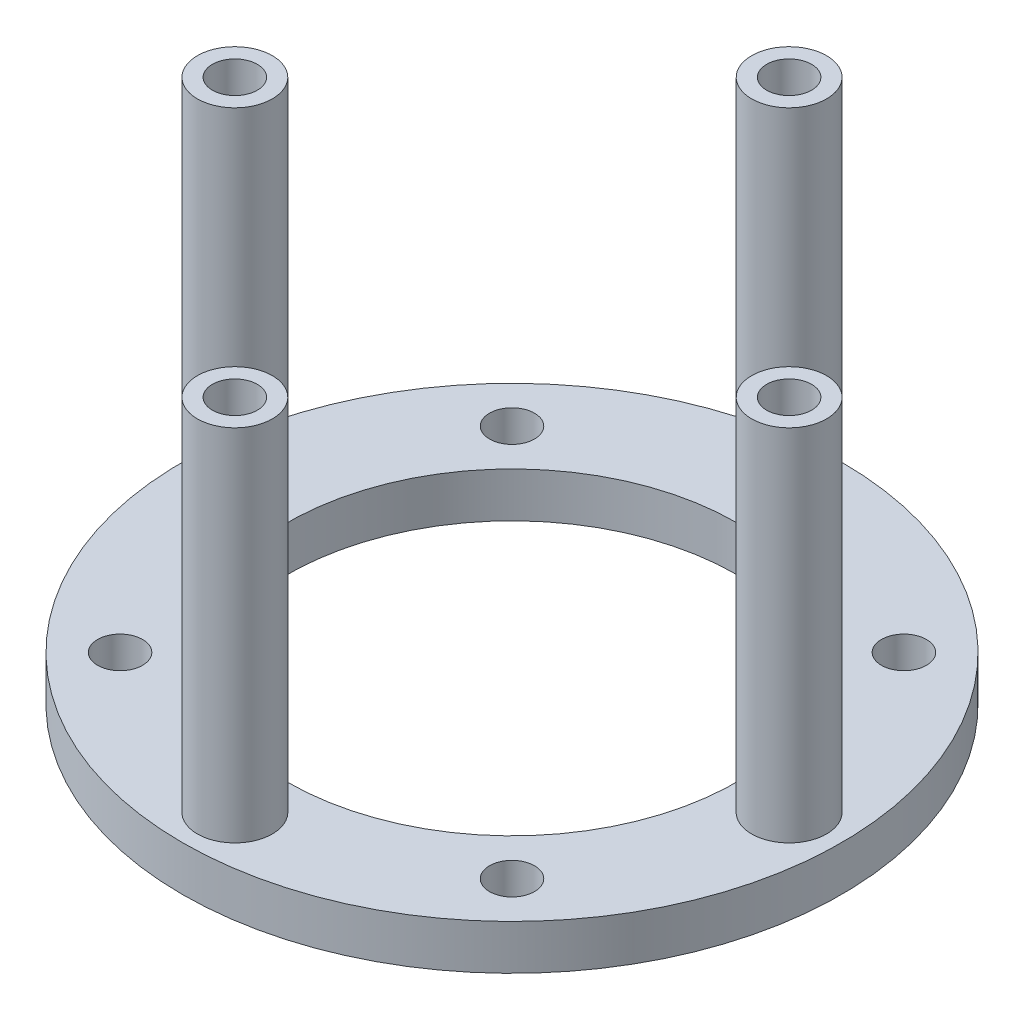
ISO-10303-21;
HEADER;
FILE_DESCRIPTION(('STEP AP214'),'2;1');
FILE_NAME('part.step','',(''),(''),'','','');
FILE_SCHEMA(('AUTOMOTIVE_DESIGN { 1 0 10303 214 1 1 1 1 }'));
ENDSEC;
DATA;
#1=APPLICATION_CONTEXT('core data for automotive mechanical design processes');
#2=APPLICATION_PROTOCOL_DEFINITION('international standard','automotive_design',2000,#1);
#3=PRODUCT_CONTEXT('',#1,'mechanical');
#4=PRODUCT('Part','Part','',(#3));
#5=PRODUCT_RELATED_PRODUCT_CATEGORY('part','',(#4));
#6=PRODUCT_DEFINITION_FORMATION('','',#4);
#7=PRODUCT_DEFINITION_CONTEXT('part definition',#1,'design');
#8=PRODUCT_DEFINITION('design','',#6,#7);
#9=PRODUCT_DEFINITION_SHAPE('','',#8);
#10=(LENGTH_UNIT() NAMED_UNIT(*) SI_UNIT(.MILLI.,.METRE.));
#11=(NAMED_UNIT(*) PLANE_ANGLE_UNIT() SI_UNIT($,.RADIAN.));
#12=(NAMED_UNIT(*) SI_UNIT($,.STERADIAN.) SOLID_ANGLE_UNIT());
#13=UNCERTAINTY_MEASURE_WITH_UNIT(LENGTH_MEASURE(1.E-05),#10,'distance_accuracy_value','');
#14=(GEOMETRIC_REPRESENTATION_CONTEXT(3) GLOBAL_UNCERTAINTY_ASSIGNED_CONTEXT((#13)) GLOBAL_UNIT_ASSIGNED_CONTEXT((#10,
#11,#12)) REPRESENTATION_CONTEXT('',''));
#15=CARTESIAN_POINT('',(0.,0.,0.));
#16=DIRECTION('',(0.,0.,1.));
#17=DIRECTION('',(1.,0.,0.));
#18=AXIS2_PLACEMENT_3D('',#15,#16,#17);
#19=CARTESIAN_POINT('',(0.,3.,0.));
#20=DIRECTION('',(0.,1.,0.));
#21=DIRECTION('',(0.,0.,1.));
#22=AXIS2_PLACEMENT_3D('',#19,#20,#21);
#23=PLANE('',#22);
#24=CARTESIAN_POINT('',(-13.081475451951,3.,-13.0814754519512));
#25=DIRECTION('',(0.,1.,0.));
#26=DIRECTION('',(0.,0.,1.));
#27=AXIS2_PLACEMENT_3D('',#24,#25,#26);
#28=CIRCLE('',#27,1.5);
#29=CARTESIAN_POINT('',(-13.081475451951,3.,-11.5814754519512));
#30=VERTEX_POINT('',#29);
#31=EDGE_CURVE('E158',#30,#30,#28,.T.);
#32=ORIENTED_EDGE('',*,*,#31,.F.);
#33=EDGE_LOOP('',(#32));
#34=FACE_BOUND('',#33,.T.);
#35=CARTESIAN_POINT('',(-13.0814754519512,3.,13.0814754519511));
#36=DIRECTION('',(0.,1.,0.));
#37=DIRECTION('',(0.,0.,1.));
#38=AXIS2_PLACEMENT_3D('',#35,#36,#37);
#39=CIRCLE('',#38,1.5);
#40=CARTESIAN_POINT('',(-13.0814754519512,3.,14.5814754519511));
#41=VERTEX_POINT('',#40);
#42=EDGE_CURVE('E162',#41,#41,#39,.T.);
#43=ORIENTED_EDGE('',*,*,#42,.F.);
#44=EDGE_LOOP('',(#43));
#45=FACE_BOUND('',#44,.T.);
#46=CARTESIAN_POINT('',(13.0814754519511,3.,13.0814754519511));
#47=DIRECTION('',(0.,1.,0.));
#48=DIRECTION('',(0.,0.,1.));
#49=AXIS2_PLACEMENT_3D('',#46,#47,#48);
#50=CIRCLE('',#49,1.5);
#51=CARTESIAN_POINT('',(13.0814754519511,3.,14.5814754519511));
#52=VERTEX_POINT('',#51);
#53=EDGE_CURVE('E166',#52,#52,#50,.T.);
#54=ORIENTED_EDGE('',*,*,#53,.F.);
#55=EDGE_LOOP('',(#54));
#56=FACE_BOUND('',#55,.T.);
#57=CARTESIAN_POINT('',(13.0814754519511,3.,-13.0814754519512));
#58=DIRECTION('',(0.,1.,0.));
#59=DIRECTION('',(0.,0.,1.));
#60=AXIS2_PLACEMENT_3D('',#57,#58,#59);
#61=CIRCLE('',#60,1.5);
#62=CARTESIAN_POINT('',(13.0814754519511,3.,-11.5814754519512));
#63=VERTEX_POINT('',#62);
#64=EDGE_CURVE('E69',#63,#63,#61,.T.);
#65=ORIENTED_EDGE('',*,*,#64,.F.);
#66=EDGE_LOOP('',(#65));
#67=FACE_BOUND('',#66,.T.);
#68=CARTESIAN_POINT('',(-18.5,3.,-1.93777214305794E-13));
#69=DIRECTION('',(0.,1.,0.));
#70=DIRECTION('',(0.,0.,1.));
#71=AXIS2_PLACEMENT_3D('',#68,#69,#70);
#72=CIRCLE('',#71,2.5);
#73=CARTESIAN_POINT('',(-18.5,3.,2.49999999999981));
#74=VERTEX_POINT('',#73);
#75=EDGE_CURVE('E94',#74,#74,#72,.T.);
#76=ORIENTED_EDGE('',*,*,#75,.F.);
#77=EDGE_LOOP('',(#76));
#78=FACE_BOUND('',#77,.T.);
#79=CARTESIAN_POINT('',(-1.29184809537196E-13,3.,18.5));
#80=DIRECTION('',(0.,1.,0.));
#81=DIRECTION('',(0.,0.,1.));
#82=AXIS2_PLACEMENT_3D('',#79,#80,#81);
#83=CIRCLE('',#82,2.5);
#84=CARTESIAN_POINT('',(-1.29184809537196E-13,3.,21.));
#85=VERTEX_POINT('',#84);
#86=EDGE_CURVE('E104',#85,#85,#83,.T.);
#87=ORIENTED_EDGE('',*,*,#86,.F.);
#88=EDGE_LOOP('',(#87));
#89=FACE_BOUND('',#88,.T.);
#90=CARTESIAN_POINT('',(18.5,3.,0.));
#91=DIRECTION('',(0.,1.,0.));
#92=DIRECTION('',(0.,0.,1.));
#93=AXIS2_PLACEMENT_3D('',#90,#91,#92);
#94=CIRCLE('',#93,2.5);
#95=CARTESIAN_POINT('',(18.5,3.,2.50000000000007));
#96=VERTEX_POINT('',#95);
#97=EDGE_CURVE('E112',#96,#96,#94,.T.);
#98=ORIENTED_EDGE('',*,*,#97,.F.);
#99=EDGE_LOOP('',(#98));
#100=FACE_BOUND('',#99,.T.);
#101=CARTESIAN_POINT('',(0.,3.,-18.5));
#102=DIRECTION('',(0.,1.,0.));
#103=DIRECTION('',(0.,0.,1.));
#104=AXIS2_PLACEMENT_3D('',#101,#102,#103);
#105=CIRCLE('',#104,2.5);
#106=CARTESIAN_POINT('',(0.,3.,-16.));
#107=VERTEX_POINT('',#106);
#108=EDGE_CURVE('E116',#107,#107,#105,.T.);
#109=ORIENTED_EDGE('',*,*,#108,.F.);
#110=EDGE_LOOP('',(#109));
#111=FACE_BOUND('',#110,.T.);
#112=CARTESIAN_POINT('',(0.,3.,0.));
#113=DIRECTION('',(0.,1.,0.));
#114=DIRECTION('',(0.,0.,1.));
#115=AXIS2_PLACEMENT_3D('',#112,#113,#114);
#116=CIRCLE('',#115,22.);
#117=CARTESIAN_POINT('',(0.,3.,22.));
#118=VERTEX_POINT('',#117);
#119=EDGE_CURVE('E10',#118,#118,#116,.T.);
#120=ORIENTED_EDGE('',*,*,#119,.T.);
#121=EDGE_LOOP('',(#120));
#122=FACE_BOUND('',#121,.T.);
#123=CARTESIAN_POINT('',(0.,3.,0.));
#124=DIRECTION('',(0.,1.,0.));
#125=DIRECTION('',(0.,0.,1.));
#126=AXIS2_PLACEMENT_3D('',#123,#124,#125);
#127=CIRCLE('',#126,15.);
#128=CARTESIAN_POINT('',(0.,3.,15.));
#129=VERTEX_POINT('',#128);
#130=EDGE_CURVE('E58',#129,#129,#127,.T.);
#131=ORIENTED_EDGE('',*,*,#130,.F.);
#132=EDGE_LOOP('',(#131));
#133=FACE_BOUND('',#132,.T.);
#134=ADVANCED_FACE('F43',(#34,#45,#56,#67,#78,#89,#100,#111,#122,#133),#23,.T.);
#135=CARTESIAN_POINT('',(0.,0.,0.));
#136=DIRECTION('',(0.,1.,0.));
#137=DIRECTION('',(0.,0.,1.));
#138=AXIS2_PLACEMENT_3D('',#135,#136,#137);
#139=PLANE('',#138);
#140=CARTESIAN_POINT('',(-13.081475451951,0.,-13.0814754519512));
#141=DIRECTION('',(0.,1.,0.));
#142=DIRECTION('',(0.,0.,1.));
#143=AXIS2_PLACEMENT_3D('',#140,#141,#142);
#144=CIRCLE('',#143,1.5);
#145=CARTESIAN_POINT('',(-13.081475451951,0.,-11.5814754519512));
#146=VERTEX_POINT('',#145);
#147=EDGE_CURVE('E47',#146,#146,#144,.T.);
#148=ORIENTED_EDGE('',*,*,#147,.T.);
#149=EDGE_LOOP('',(#148));
#150=FACE_BOUND('',#149,.T.);
#151=CARTESIAN_POINT('',(-13.0814754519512,0.,13.0814754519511));
#152=DIRECTION('',(0.,1.,0.));
#153=DIRECTION('',(0.,0.,1.));
#154=AXIS2_PLACEMENT_3D('',#151,#152,#153);
#155=CIRCLE('',#154,1.5);
#156=CARTESIAN_POINT('',(-13.0814754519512,0.,14.5814754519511));
#157=VERTEX_POINT('',#156);
#158=EDGE_CURVE('E72',#157,#157,#155,.T.);
#159=ORIENTED_EDGE('',*,*,#158,.T.);
#160=EDGE_LOOP('',(#159));
#161=FACE_BOUND('',#160,.T.);
#162=CARTESIAN_POINT('',(13.0814754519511,0.,13.0814754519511));
#163=DIRECTION('',(0.,1.,0.));
#164=DIRECTION('',(0.,0.,1.));
#165=AXIS2_PLACEMENT_3D('',#162,#163,#164);
#166=CIRCLE('',#165,1.5);
#167=CARTESIAN_POINT('',(13.0814754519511,0.,14.5814754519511));
#168=VERTEX_POINT('',#167);
#169=EDGE_CURVE('E68',#168,#168,#166,.T.);
#170=ORIENTED_EDGE('',*,*,#169,.T.);
#171=EDGE_LOOP('',(#170));
#172=FACE_BOUND('',#171,.T.);
#173=CARTESIAN_POINT('',(13.0814754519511,0.,-13.0814754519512));
#174=DIRECTION('',(0.,1.,0.));
#175=DIRECTION('',(0.,0.,1.));
#176=AXIS2_PLACEMENT_3D('',#173,#174,#175);
#177=CIRCLE('',#176,1.5);
#178=CARTESIAN_POINT('',(13.0814754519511,0.,-11.5814754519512));
#179=VERTEX_POINT('',#178);
#180=EDGE_CURVE('E64',#179,#179,#177,.T.);
#181=ORIENTED_EDGE('',*,*,#180,.T.);
#182=EDGE_LOOP('',(#181));
#183=FACE_BOUND('',#182,.T.);
#184=CARTESIAN_POINT('',(0.,0.,0.));
#185=DIRECTION('',(0.,1.,0.));
#186=DIRECTION('',(0.,0.,1.));
#187=AXIS2_PLACEMENT_3D('',#184,#185,#186);
#188=CIRCLE('',#187,22.);
#189=CARTESIAN_POINT('',(0.,0.,22.));
#190=VERTEX_POINT('',#189);
#191=EDGE_CURVE('E52',#190,#190,#188,.T.);
#192=ORIENTED_EDGE('',*,*,#191,.F.);
#193=EDGE_LOOP('',(#192));
#194=FACE_BOUND('',#193,.T.);
#195=CARTESIAN_POINT('',(0.,0.,0.));
#196=DIRECTION('',(0.,1.,0.));
#197=DIRECTION('',(0.,0.,1.));
#198=AXIS2_PLACEMENT_3D('',#195,#196,#197);
#199=CIRCLE('',#198,15.);
#200=CARTESIAN_POINT('',(0.,0.,15.));
#201=VERTEX_POINT('',#200);
#202=EDGE_CURVE('E61',#201,#201,#199,.T.);
#203=ORIENTED_EDGE('',*,*,#202,.T.);
#204=EDGE_LOOP('',(#203));
#205=FACE_BOUND('',#204,.T.);
#206=ADVANCED_FACE('F134',(#150,#161,#172,#183,#194,#205),#139,.F.);
#207=CARTESIAN_POINT('',(0.,3.,0.));
#208=DIRECTION('',(0.,-1.,0.));
#209=DIRECTION('',(0.,0.,-1.));
#210=AXIS2_PLACEMENT_3D('',#207,#208,#209);
#211=CYLINDRICAL_SURFACE('',#210,22.);
#212=ORIENTED_EDGE('',*,*,#119,.F.);
#213=EDGE_LOOP('',(#212));
#214=FACE_BOUND('',#213,.T.);
#215=ORIENTED_EDGE('',*,*,#191,.T.);
#216=EDGE_LOOP('',(#215));
#217=FACE_BOUND('',#216,.T.);
#218=ADVANCED_FACE('F45',(#214,#217),#211,.T.);
#219=CARTESIAN_POINT('',(0.,3.,0.));
#220=DIRECTION('',(0.,-1.,0.));
#221=DIRECTION('',(0.,0.,-1.));
#222=AXIS2_PLACEMENT_3D('',#219,#220,#221);
#223=CYLINDRICAL_SURFACE('',#222,15.);
#224=ORIENTED_EDGE('',*,*,#130,.T.);
#225=EDGE_LOOP('',(#224));
#226=FACE_BOUND('',#225,.T.);
#227=ORIENTED_EDGE('',*,*,#202,.F.);
#228=EDGE_LOOP('',(#227));
#229=FACE_BOUND('',#228,.T.);
#230=ADVANCED_FACE('F136',(#226,#229),#223,.F.);
#231=CARTESIAN_POINT('',(0.,27.,-18.5));
#232=DIRECTION('',(0.,-1.,0.));
#233=DIRECTION('',(0.,0.,-1.));
#234=AXIS2_PLACEMENT_3D('',#231,#232,#233);
#235=CYLINDRICAL_SURFACE('',#234,2.5);
#236=CARTESIAN_POINT('',(0.,27.,-18.5));
#237=DIRECTION('',(0.,1.,0.));
#238=DIRECTION('',(0.,0.,1.));
#239=AXIS2_PLACEMENT_3D('',#236,#237,#238);
#240=CIRCLE('',#239,2.5);
#241=CARTESIAN_POINT('',(0.,27.,-16.));
#242=VERTEX_POINT('',#241);
#243=EDGE_CURVE('E120',#242,#242,#240,.T.);
#244=ORIENTED_EDGE('',*,*,#243,.F.);
#245=EDGE_LOOP('',(#244));
#246=FACE_BOUND('',#245,.T.);
#247=ORIENTED_EDGE('',*,*,#108,.T.);
#248=EDGE_LOOP('',(#247));
#249=FACE_BOUND('',#248,.T.);
#250=ADVANCED_FACE('F138',(#246,#249),#235,.T.);
#251=CARTESIAN_POINT('',(0.,27.,-18.5));
#252=DIRECTION('',(0.,1.,0.));
#253=DIRECTION('',(0.,0.,1.));
#254=AXIS2_PLACEMENT_3D('',#251,#252,#253);
#255=PLANE('',#254);
#256=CARTESIAN_POINT('',(0.,27.,-18.5));
#257=DIRECTION('',(0.,1.,0.));
#258=DIRECTION('',(0.,0.,1.));
#259=AXIS2_PLACEMENT_3D('',#256,#257,#258);
#260=CIRCLE('',#259,1.5);
#261=CARTESIAN_POINT('',(0.,27.,-17.));
#262=VERTEX_POINT('',#261);
#263=EDGE_CURVE('E283',#262,#262,#260,.T.);
#264=ORIENTED_EDGE('',*,*,#263,.F.);
#265=EDGE_LOOP('',(#264));
#266=FACE_BOUND('',#265,.T.);
#267=ORIENTED_EDGE('',*,*,#243,.T.);
#268=EDGE_LOOP('',(#267));
#269=FACE_BOUND('',#268,.T.);
#270=ADVANCED_FACE('F144',(#266,#269),#255,.T.);
#271=CARTESIAN_POINT('',(18.5,27.,0.));
#272=DIRECTION('',(0.,-1.,0.));
#273=DIRECTION('',(0.,0.,-1.));
#274=AXIS2_PLACEMENT_3D('',#271,#272,#273);
#275=CYLINDRICAL_SURFACE('',#274,2.5);
#276=CARTESIAN_POINT('',(18.5,27.,0.));
#277=DIRECTION('',(0.,1.,0.));
#278=DIRECTION('',(0.,0.,1.));
#279=AXIS2_PLACEMENT_3D('',#276,#277,#278);
#280=CIRCLE('',#279,2.5);
#281=CARTESIAN_POINT('',(18.5,27.,2.50000000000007));
#282=VERTEX_POINT('',#281);
#283=EDGE_CURVE('E108',#282,#282,#280,.T.);
#284=ORIENTED_EDGE('',*,*,#283,.F.);
#285=EDGE_LOOP('',(#284));
#286=FACE_BOUND('',#285,.T.);
#287=ORIENTED_EDGE('',*,*,#97,.T.);
#288=EDGE_LOOP('',(#287));
#289=FACE_BOUND('',#288,.T.);
#290=ADVANCED_FACE('F180',(#286,#289),#275,.T.);
#291=CARTESIAN_POINT('',(18.5,27.,0.));
#292=DIRECTION('',(0.,1.,0.));
#293=DIRECTION('',(0.,0.,1.));
#294=AXIS2_PLACEMENT_3D('',#291,#292,#293);
#295=PLANE('',#294);
#296=CARTESIAN_POINT('',(18.5,27.,0.));
#297=DIRECTION('',(0.,1.,0.));
#298=DIRECTION('',(0.,0.,1.));
#299=AXIS2_PLACEMENT_3D('',#296,#297,#298);
#300=CIRCLE('',#299,1.5);
#301=CARTESIAN_POINT('',(18.5,27.,1.50000000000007));
#302=VERTEX_POINT('',#301);
#303=EDGE_CURVE('E291',#302,#302,#300,.T.);
#304=ORIENTED_EDGE('',*,*,#303,.F.);
#305=EDGE_LOOP('',(#304));
#306=FACE_BOUND('',#305,.T.);
#307=ORIENTED_EDGE('',*,*,#283,.T.);
#308=EDGE_LOOP('',(#307));
#309=FACE_BOUND('',#308,.T.);
#310=ADVANCED_FACE('F182',(#306,#309),#295,.T.);
#311=CARTESIAN_POINT('',(-1.29184809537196E-13,27.,18.5));
#312=DIRECTION('',(0.,-1.,0.));
#313=DIRECTION('',(0.,0.,-1.));
#314=AXIS2_PLACEMENT_3D('',#311,#312,#313);
#315=CYLINDRICAL_SURFACE('',#314,2.5);
#316=CARTESIAN_POINT('',(-1.29184809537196E-13,27.,18.5));
#317=DIRECTION('',(0.,1.,0.));
#318=DIRECTION('',(0.,0.,1.));
#319=AXIS2_PLACEMENT_3D('',#316,#317,#318);
#320=CIRCLE('',#319,2.5);
#321=CARTESIAN_POINT('',(-1.29184809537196E-13,27.,21.));
#322=VERTEX_POINT('',#321);
#323=EDGE_CURVE('E98',#322,#322,#320,.T.);
#324=ORIENTED_EDGE('',*,*,#323,.F.);
#325=EDGE_LOOP('',(#324));
#326=FACE_BOUND('',#325,.T.);
#327=ORIENTED_EDGE('',*,*,#86,.T.);
#328=EDGE_LOOP('',(#327));
#329=FACE_BOUND('',#328,.T.);
#330=ADVANCED_FACE('F189',(#326,#329),#315,.T.);
#331=CARTESIAN_POINT('',(-1.29184809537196E-13,27.,18.5));
#332=DIRECTION('',(0.,1.,0.));
#333=DIRECTION('',(0.,0.,1.));
#334=AXIS2_PLACEMENT_3D('',#331,#332,#333);
#335=PLANE('',#334);
#336=CARTESIAN_POINT('',(-1.29184809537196E-13,27.,18.5));
#337=DIRECTION('',(0.,1.,0.));
#338=DIRECTION('',(0.,0.,1.));
#339=AXIS2_PLACEMENT_3D('',#336,#337,#338);
#340=CIRCLE('',#339,1.5);
#341=CARTESIAN_POINT('',(-1.29184809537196E-13,27.,20.));
#342=VERTEX_POINT('',#341);
#343=EDGE_CURVE('E84',#342,#342,#340,.T.);
#344=ORIENTED_EDGE('',*,*,#343,.F.);
#345=EDGE_LOOP('',(#344));
#346=FACE_BOUND('',#345,.T.);
#347=ORIENTED_EDGE('',*,*,#323,.T.);
#348=EDGE_LOOP('',(#347));
#349=FACE_BOUND('',#348,.T.);
#350=ADVANCED_FACE('F197',(#346,#349),#335,.T.);
#351=CARTESIAN_POINT('',(-18.5,27.,-1.93777214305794E-13));
#352=DIRECTION('',(0.,-1.,0.));
#353=DIRECTION('',(0.,0.,-1.));
#354=AXIS2_PLACEMENT_3D('',#351,#352,#353);
#355=CYLINDRICAL_SURFACE('',#354,2.5);
#356=CARTESIAN_POINT('',(-18.5,27.,-1.93777214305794E-13));
#357=DIRECTION('',(0.,1.,0.));
#358=DIRECTION('',(0.,0.,1.));
#359=AXIS2_PLACEMENT_3D('',#356,#357,#358);
#360=CIRCLE('',#359,2.5);
#361=CARTESIAN_POINT('',(-18.5,27.,2.49999999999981));
#362=VERTEX_POINT('',#361);
#363=EDGE_CURVE('E99',#362,#362,#360,.T.);
#364=ORIENTED_EDGE('',*,*,#363,.F.);
#365=EDGE_LOOP('',(#364));
#366=FACE_BOUND('',#365,.T.);
#367=ORIENTED_EDGE('',*,*,#75,.T.);
#368=EDGE_LOOP('',(#367));
#369=FACE_BOUND('',#368,.T.);
#370=ADVANCED_FACE('F200',(#366,#369),#355,.T.);
#371=CARTESIAN_POINT('',(-18.5,27.,-1.93777214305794E-13));
#372=DIRECTION('',(0.,1.,0.));
#373=DIRECTION('',(0.,0.,1.));
#374=AXIS2_PLACEMENT_3D('',#371,#372,#373);
#375=PLANE('',#374);
#376=CARTESIAN_POINT('',(-18.5,27.,-1.93777214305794E-13));
#377=DIRECTION('',(0.,1.,0.));
#378=DIRECTION('',(0.,0.,1.));
#379=AXIS2_PLACEMENT_3D('',#376,#377,#378);
#380=CIRCLE('',#379,1.5);
#381=CARTESIAN_POINT('',(-18.5,27.,1.49999999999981));
#382=VERTEX_POINT('',#381);
#383=EDGE_CURVE('E279',#382,#382,#380,.T.);
#384=ORIENTED_EDGE('',*,*,#383,.F.);
#385=EDGE_LOOP('',(#384));
#386=FACE_BOUND('',#385,.T.);
#387=ORIENTED_EDGE('',*,*,#363,.T.);
#388=EDGE_LOOP('',(#387));
#389=FACE_BOUND('',#388,.T.);
#390=ADVANCED_FACE('F204',(#386,#389),#375,.T.);
#391=CARTESIAN_POINT('',(-18.5,21.,-1.93777214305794E-13));
#392=DIRECTION('',(0.,1.,0.));
#393=DIRECTION('',(0.,0.,1.));
#394=AXIS2_PLACEMENT_3D('',#391,#392,#393);
#395=CYLINDRICAL_SURFACE('',#394,1.5);
#396=CARTESIAN_POINT('',(-18.5,21.,-1.93777214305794E-13));
#397=DIRECTION('',(0.,1.,0.));
#398=DIRECTION('',(0.,0.,1.));
#399=AXIS2_PLACEMENT_3D('',#396,#397,#398);
#400=CIRCLE('',#399,1.5);
#401=CARTESIAN_POINT('',(-18.5,21.,1.49999999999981));
#402=VERTEX_POINT('',#401);
#403=EDGE_CURVE('E103',#402,#402,#400,.T.);
#404=ORIENTED_EDGE('',*,*,#403,.F.);
#405=EDGE_LOOP('',(#404));
#406=FACE_BOUND('',#405,.T.);
#407=ORIENTED_EDGE('',*,*,#383,.T.);
#408=EDGE_LOOP('',(#407));
#409=FACE_BOUND('',#408,.T.);
#410=ADVANCED_FACE('F207',(#406,#409),#395,.F.);
#411=CARTESIAN_POINT('',(-18.5,21.,-1.93777214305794E-13));
#412=DIRECTION('',(0.,1.,0.));
#413=DIRECTION('',(0.,0.,1.));
#414=AXIS2_PLACEMENT_3D('',#411,#412,#413);
#415=PLANE('',#414);
#416=ORIENTED_EDGE('',*,*,#403,.T.);
#417=EDGE_LOOP('',(#416));
#418=FACE_BOUND('',#417,.T.);
#419=ADVANCED_FACE('F219',(#418),#415,.T.);
#420=CARTESIAN_POINT('',(-1.29184809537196E-13,21.,18.5));
#421=DIRECTION('',(0.,1.,0.));
#422=DIRECTION('',(0.,0.,1.));
#423=AXIS2_PLACEMENT_3D('',#420,#421,#422);
#424=CYLINDRICAL_SURFACE('',#423,1.5);
#425=CARTESIAN_POINT('',(-1.29184809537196E-13,21.,18.5));
#426=DIRECTION('',(0.,1.,0.));
#427=DIRECTION('',(0.,0.,1.));
#428=AXIS2_PLACEMENT_3D('',#425,#426,#427);
#429=CIRCLE('',#428,1.5);
#430=CARTESIAN_POINT('',(-1.29184809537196E-13,21.,20.));
#431=VERTEX_POINT('',#430);
#432=EDGE_CURVE('E79',#431,#431,#429,.T.);
#433=ORIENTED_EDGE('',*,*,#432,.F.);
#434=EDGE_LOOP('',(#433));
#435=FACE_BOUND('',#434,.T.);
#436=ORIENTED_EDGE('',*,*,#343,.T.);
#437=EDGE_LOOP('',(#436));
#438=FACE_BOUND('',#437,.T.);
#439=ADVANCED_FACE('F216',(#435,#438),#424,.F.);
#440=CARTESIAN_POINT('',(-1.29184809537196E-13,21.,18.5));
#441=DIRECTION('',(0.,1.,0.));
#442=DIRECTION('',(0.,0.,1.));
#443=AXIS2_PLACEMENT_3D('',#440,#441,#442);
#444=PLANE('',#443);
#445=ORIENTED_EDGE('',*,*,#432,.T.);
#446=EDGE_LOOP('',(#445));
#447=FACE_BOUND('',#446,.T.);
#448=ADVANCED_FACE('F212',(#447),#444,.T.);
#449=CARTESIAN_POINT('',(18.5,21.,0.));
#450=DIRECTION('',(0.,1.,0.));
#451=DIRECTION('',(0.,0.,1.));
#452=AXIS2_PLACEMENT_3D('',#449,#450,#451);
#453=CYLINDRICAL_SURFACE('',#452,1.5);
#454=CARTESIAN_POINT('',(18.5,21.,0.));
#455=DIRECTION('',(0.,1.,0.));
#456=DIRECTION('',(0.,0.,1.));
#457=AXIS2_PLACEMENT_3D('',#454,#455,#456);
#458=CIRCLE('',#457,1.5);
#459=CARTESIAN_POINT('',(18.5,21.,1.50000000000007));
#460=VERTEX_POINT('',#459);
#461=EDGE_CURVE('E90',#460,#460,#458,.T.);
#462=ORIENTED_EDGE('',*,*,#461,.F.);
#463=EDGE_LOOP('',(#462));
#464=FACE_BOUND('',#463,.T.);
#465=ORIENTED_EDGE('',*,*,#303,.T.);
#466=EDGE_LOOP('',(#465));
#467=FACE_BOUND('',#466,.T.);
#468=ADVANCED_FACE('F215',(#464,#467),#453,.F.);
#469=CARTESIAN_POINT('',(18.5,21.,0.));
#470=DIRECTION('',(0.,1.,0.));
#471=DIRECTION('',(0.,0.,1.));
#472=AXIS2_PLACEMENT_3D('',#469,#470,#471);
#473=PLANE('',#472);
#474=ORIENTED_EDGE('',*,*,#461,.T.);
#475=EDGE_LOOP('',(#474));
#476=FACE_BOUND('',#475,.T.);
#477=ADVANCED_FACE('F221',(#476),#473,.T.);
#478=CARTESIAN_POINT('',(0.,21.,-18.5));
#479=DIRECTION('',(0.,1.,0.));
#480=DIRECTION('',(0.,0.,1.));
#481=AXIS2_PLACEMENT_3D('',#478,#479,#480);
#482=CYLINDRICAL_SURFACE('',#481,1.5);
#483=CARTESIAN_POINT('',(0.,21.,-18.5));
#484=DIRECTION('',(0.,1.,0.));
#485=DIRECTION('',(0.,0.,1.));
#486=AXIS2_PLACEMENT_3D('',#483,#484,#485);
#487=CIRCLE('',#486,1.5);
#488=CARTESIAN_POINT('',(0.,21.,-17.));
#489=VERTEX_POINT('',#488);
#490=EDGE_CURVE('E287',#489,#489,#487,.T.);
#491=ORIENTED_EDGE('',*,*,#490,.F.);
#492=EDGE_LOOP('',(#491));
#493=FACE_BOUND('',#492,.T.);
#494=ORIENTED_EDGE('',*,*,#263,.T.);
#495=EDGE_LOOP('',(#494));
#496=FACE_BOUND('',#495,.T.);
#497=ADVANCED_FACE('F224',(#493,#496),#482,.F.);
#498=CARTESIAN_POINT('',(0.,21.,-18.5));
#499=DIRECTION('',(0.,1.,0.));
#500=DIRECTION('',(0.,0.,1.));
#501=AXIS2_PLACEMENT_3D('',#498,#499,#500);
#502=PLANE('',#501);
#503=ORIENTED_EDGE('',*,*,#490,.T.);
#504=EDGE_LOOP('',(#503));
#505=FACE_BOUND('',#504,.T.);
#506=ADVANCED_FACE('F229',(#505),#502,.T.);
#507=CARTESIAN_POINT('',(13.0814754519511,-3.,-13.0814754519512));
#508=DIRECTION('',(0.,1.,0.));
#509=DIRECTION('',(0.,0.,1.));
#510=AXIS2_PLACEMENT_3D('',#507,#508,#509);
#511=CYLINDRICAL_SURFACE('',#510,1.5);
#512=ORIENTED_EDGE('',*,*,#64,.T.);
#513=EDGE_LOOP('',(#512));
#514=FACE_BOUND('',#513,.T.);
#515=ORIENTED_EDGE('',*,*,#180,.F.);
#516=EDGE_LOOP('',(#515));
#517=FACE_BOUND('',#516,.T.);
#518=ADVANCED_FACE('F231',(#514,#517),#511,.F.);
#519=CARTESIAN_POINT('',(13.0814754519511,-3.,13.0814754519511));
#520=DIRECTION('',(0.,1.,0.));
#521=DIRECTION('',(0.,0.,1.));
#522=AXIS2_PLACEMENT_3D('',#519,#520,#521);
#523=CYLINDRICAL_SURFACE('',#522,1.5);
#524=ORIENTED_EDGE('',*,*,#53,.T.);
#525=EDGE_LOOP('',(#524));
#526=FACE_BOUND('',#525,.T.);
#527=ORIENTED_EDGE('',*,*,#169,.F.);
#528=EDGE_LOOP('',(#527));
#529=FACE_BOUND('',#528,.T.);
#530=ADVANCED_FACE('F244',(#526,#529),#523,.F.);
#531=CARTESIAN_POINT('',(-13.0814754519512,-3.,13.0814754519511));
#532=DIRECTION('',(0.,1.,0.));
#533=DIRECTION('',(0.,0.,1.));
#534=AXIS2_PLACEMENT_3D('',#531,#532,#533);
#535=CYLINDRICAL_SURFACE('',#534,1.5);
#536=ORIENTED_EDGE('',*,*,#42,.T.);
#537=EDGE_LOOP('',(#536));
#538=FACE_BOUND('',#537,.T.);
#539=ORIENTED_EDGE('',*,*,#158,.F.);
#540=EDGE_LOOP('',(#539));
#541=FACE_BOUND('',#540,.T.);
#542=ADVANCED_FACE('F249',(#538,#541),#535,.F.);
#543=CARTESIAN_POINT('',(-13.081475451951,-3.,-13.0814754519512));
#544=DIRECTION('',(0.,1.,0.));
#545=DIRECTION('',(0.,0.,1.));
#546=AXIS2_PLACEMENT_3D('',#543,#544,#545);
#547=CYLINDRICAL_SURFACE('',#546,1.5);
#548=ORIENTED_EDGE('',*,*,#31,.T.);
#549=EDGE_LOOP('',(#548));
#550=FACE_BOUND('',#549,.T.);
#551=ORIENTED_EDGE('',*,*,#147,.F.);
#552=EDGE_LOOP('',(#551));
#553=FACE_BOUND('',#552,.T.);
#554=ADVANCED_FACE('F246',(#550,#553),#547,.F.);
#555=CLOSED_SHELL('',(#134,#206,#218,#230,#250,#270,#290,#310,#330,#350,#370,#390,#410,#419,
#439,#448,#468,#477,#497,#506,#518,#530,#542,#554));
#556=MANIFOLD_SOLID_BREP('B2',#555);
#557=ADVANCED_BREP_SHAPE_REPRESENTATION('',(#18,#556),#14);
#558=SHAPE_DEFINITION_REPRESENTATION(#9,#557);
ENDSEC;
END-ISO-10303-21;
